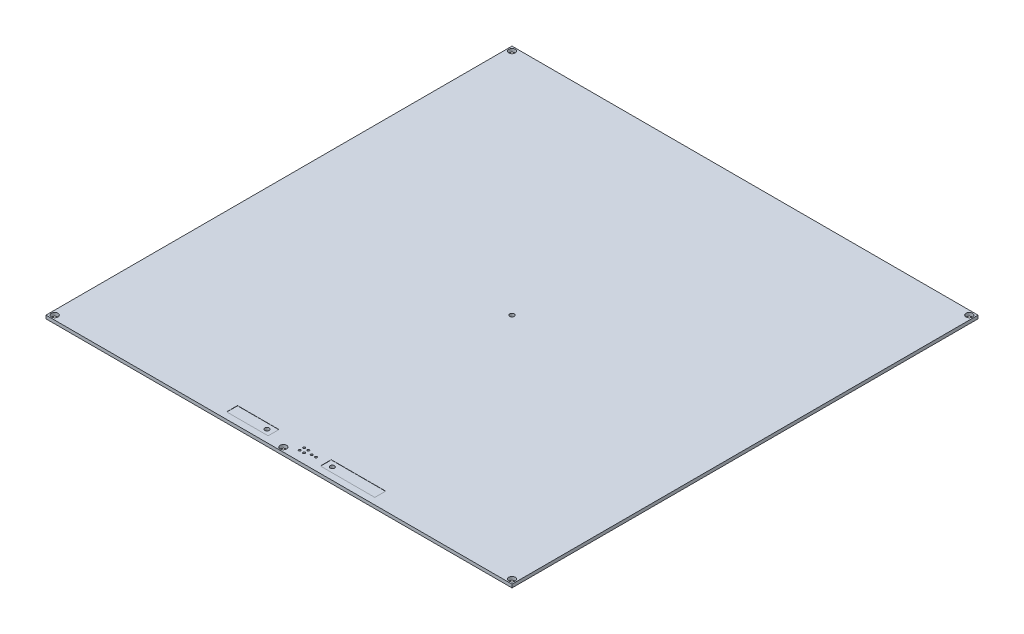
ISO-10303-21;
HEADER;
FILE_DESCRIPTION(('STEP AP214'),'2;1');
FILE_NAME('part.step','',(''),(''),'','','');
FILE_SCHEMA(('AUTOMOTIVE_DESIGN { 1 0 10303 214 1 1 1 1 }'));
ENDSEC;
DATA;
#1=APPLICATION_CONTEXT('core data for automotive mechanical design processes');
#2=APPLICATION_PROTOCOL_DEFINITION('international standard','automotive_design',2000,#1);
#3=PRODUCT_CONTEXT('',#1,'mechanical');
#4=PRODUCT('Part','Part','',(#3));
#5=PRODUCT_RELATED_PRODUCT_CATEGORY('part','',(#4));
#6=PRODUCT_DEFINITION_FORMATION('','',#4);
#7=PRODUCT_DEFINITION_CONTEXT('part definition',#1,'design');
#8=PRODUCT_DEFINITION('design','',#6,#7);
#9=PRODUCT_DEFINITION_SHAPE('','',#8);
#10=(LENGTH_UNIT() NAMED_UNIT(*) SI_UNIT(.MILLI.,.METRE.));
#11=(NAMED_UNIT(*) PLANE_ANGLE_UNIT() SI_UNIT($,.RADIAN.));
#12=(NAMED_UNIT(*) SI_UNIT($,.STERADIAN.) SOLID_ANGLE_UNIT());
#13=UNCERTAINTY_MEASURE_WITH_UNIT(LENGTH_MEASURE(1.E-05),#10,'distance_accuracy_value','');
#14=(GEOMETRIC_REPRESENTATION_CONTEXT(3) GLOBAL_UNCERTAINTY_ASSIGNED_CONTEXT((#13)) GLOBAL_UNIT_ASSIGNED_CONTEXT((#10,
#11,#12)) REPRESENTATION_CONTEXT('',''));
#15=CARTESIAN_POINT('',(0.,0.,0.));
#16=DIRECTION('',(0.,0.,1.));
#17=DIRECTION('',(1.,0.,0.));
#18=AXIS2_PLACEMENT_3D('',#15,#16,#17);
#19=CARTESIAN_POINT('',(19.,0.,101.5));
#20=DIRECTION('',(0.,1.,0.));
#21=DIRECTION('',(0.,0.,1.));
#22=AXIS2_PLACEMENT_3D('',#19,#20,#21);
#23=CYLINDRICAL_SURFACE('',#22,1.);
#24=CARTESIAN_POINT('',(19.,0.,101.5));
#25=DIRECTION('',(0.,1.,0.));
#26=DIRECTION('',(0.,0.,1.));
#27=AXIS2_PLACEMENT_3D('',#24,#25,#26);
#28=CIRCLE('',#27,1.);
#29=CARTESIAN_POINT('',(19.,0.,102.5));
#30=VERTEX_POINT('',#29);
#31=EDGE_CURVE('E233',#30,#30,#28,.T.);
#32=ORIENTED_EDGE('',*,*,#31,.F.);
#33=EDGE_LOOP('',(#32));
#34=FACE_BOUND('',#33,.T.);
#35=CARTESIAN_POINT('',(19.,1.4,101.5));
#36=DIRECTION('',(0.,1.,0.));
#37=DIRECTION('',(0.,0.,1.));
#38=AXIS2_PLACEMENT_3D('',#35,#36,#37);
#39=CIRCLE('',#38,1.);
#40=CARTESIAN_POINT('',(19.,1.4,102.5));
#41=VERTEX_POINT('',#40);
#42=EDGE_CURVE('E36',#41,#41,#39,.F.);
#43=ORIENTED_EDGE('',*,*,#42,.F.);
#44=EDGE_LOOP('',(#43));
#45=FACE_BOUND('',#44,.T.);
#46=ADVANCED_FACE('F32',(#34,#45),#23,.F.);
#47=CARTESIAN_POINT('',(-11.,0.,101.5));
#48=DIRECTION('',(0.,1.,0.));
#49=DIRECTION('',(0.,0.,1.));
#50=AXIS2_PLACEMENT_3D('',#47,#48,#49);
#51=CYLINDRICAL_SURFACE('',#50,1.);
#52=CARTESIAN_POINT('',(-11.,0.,101.5));
#53=DIRECTION('',(0.,1.,0.));
#54=DIRECTION('',(0.,0.,1.));
#55=AXIS2_PLACEMENT_3D('',#52,#53,#54);
#56=CIRCLE('',#55,1.);
#57=CARTESIAN_POINT('',(-11.,0.,102.5));
#58=VERTEX_POINT('',#57);
#59=EDGE_CURVE('E238',#58,#58,#56,.T.);
#60=ORIENTED_EDGE('',*,*,#59,.F.);
#61=EDGE_LOOP('',(#60));
#62=FACE_BOUND('',#61,.T.);
#63=CARTESIAN_POINT('',(-11.,1.4,101.5));
#64=DIRECTION('',(0.,1.,0.));
#65=DIRECTION('',(0.,0.,1.));
#66=AXIS2_PLACEMENT_3D('',#63,#64,#65);
#67=CIRCLE('',#66,1.);
#68=CARTESIAN_POINT('',(-11.,1.4,102.5));
#69=VERTEX_POINT('',#68);
#70=EDGE_CURVE('E187',#69,#69,#67,.F.);
#71=ORIENTED_EDGE('',*,*,#70,.F.);
#72=EDGE_LOOP('',(#71));
#73=FACE_BOUND('',#72,.T.);
#74=ADVANCED_FACE('F301',(#62,#73),#51,.F.);
#75=CARTESIAN_POINT('',(-107.,1.5,107.));
#76=DIRECTION('',(0.,-1.,0.));
#77=DIRECTION('',(0.,0.,-1.));
#78=AXIS2_PLACEMENT_3D('',#75,#76,#77);
#79=PLANE('',#78);
#80=DIRECTION('',(1.,0.,0.));
#81=VECTOR('',#80,1.);
#82=CARTESIAN_POINT('',(16.,1.5,104.));
#83=LINE('',#82,#81);
#84=CARTESIAN_POINT('',(16.,1.5,104.));
#85=VERTEX_POINT('',#84);
#86=CARTESIAN_POINT('',(41.,1.5,104.));
#87=VERTEX_POINT('',#86);
#88=EDGE_CURVE('E153',#85,#87,#83,.T.);
#89=ORIENTED_EDGE('',*,*,#88,.F.);
#90=DIRECTION('',(0.,0.,1.));
#91=VECTOR('',#90,1.);
#92=CARTESIAN_POINT('',(16.,1.5,99.));
#93=LINE('',#92,#91);
#94=CARTESIAN_POINT('',(16.,1.5,99.));
#95=VERTEX_POINT('',#94);
#96=EDGE_CURVE('E49',#95,#85,#93,.T.);
#97=ORIENTED_EDGE('',*,*,#96,.F.);
#98=DIRECTION('',(-1.,0.,0.));
#99=VECTOR('',#98,1.);
#100=CARTESIAN_POINT('',(16.,1.5,99.));
#101=LINE('',#100,#99);
#102=CARTESIAN_POINT('',(41.,1.5,99.));
#103=VERTEX_POINT('',#102);
#104=EDGE_CURVE('E144',#103,#95,#101,.T.);
#105=ORIENTED_EDGE('',*,*,#104,.F.);
#106=DIRECTION('',(0.,0.,-1.));
#107=VECTOR('',#106,1.);
#108=CARTESIAN_POINT('',(41.,1.5,99.));
#109=LINE('',#108,#107);
#110=EDGE_CURVE('E147',#87,#103,#109,.T.);
#111=ORIENTED_EDGE('',*,*,#110,.F.);
#112=EDGE_LOOP('',(#89,#97,#105,#111));
#113=FACE_BOUND('',#112,.T.);
#114=DIRECTION('',(1.,0.,0.));
#115=VECTOR('',#114,1.);
#116=CARTESIAN_POINT('',(-27.0506494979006,1.5,104.));
#117=LINE('',#116,#115);
#118=CARTESIAN_POINT('',(-27.0506494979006,1.5,104.));
#119=VERTEX_POINT('',#118);
#120=CARTESIAN_POINT('',(-8.,1.5,104.));
#121=VERTEX_POINT('',#120);
#122=EDGE_CURVE('E177',#119,#121,#117,.T.);
#123=ORIENTED_EDGE('',*,*,#122,.F.);
#124=DIRECTION('',(0.,0.,1.));
#125=VECTOR('',#124,1.);
#126=CARTESIAN_POINT('',(-27.0506494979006,1.5,99.));
#127=LINE('',#126,#125);
#128=CARTESIAN_POINT('',(-27.0506494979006,1.5,99.));
#129=VERTEX_POINT('',#128);
#130=EDGE_CURVE('E57',#129,#119,#127,.T.);
#131=ORIENTED_EDGE('',*,*,#130,.F.);
#132=DIRECTION('',(-1.,0.,0.));
#133=VECTOR('',#132,1.);
#134=CARTESIAN_POINT('',(-27.0506494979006,1.5,99.));
#135=LINE('',#134,#133);
#136=CARTESIAN_POINT('',(-8.,1.5,99.));
#137=VERTEX_POINT('',#136);
#138=EDGE_CURVE('E166',#137,#129,#135,.T.);
#139=ORIENTED_EDGE('',*,*,#138,.F.);
#140=DIRECTION('',(0.,0.,-1.));
#141=VECTOR('',#140,1.);
#142=CARTESIAN_POINT('',(-8.,1.5,99.));
#143=LINE('',#142,#141);
#144=EDGE_CURVE('E180',#121,#137,#143,.T.);
#145=ORIENTED_EDGE('',*,*,#144,.F.);
#146=EDGE_LOOP('',(#123,#131,#139,#145));
#147=FACE_BOUND('',#146,.T.);
#148=CARTESIAN_POINT('',(0.,1.5,0.));
#149=DIRECTION('',(0.,1.,0.));
#150=DIRECTION('',(0.,0.,1.));
#151=AXIS2_PLACEMENT_3D('',#148,#149,#150);
#152=CIRCLE('',#151,1.05);
#153=CARTESIAN_POINT('',(0.,1.5,1.05));
#154=VERTEX_POINT('',#153);
#155=EDGE_CURVE('E197',#154,#154,#152,.T.);
#156=ORIENTED_EDGE('',*,*,#155,.F.);
#157=EDGE_LOOP('',(#156));
#158=FACE_BOUND('',#157,.T.);
#159=CARTESIAN_POINT('',(11.5,1.5,101.5));
#160=DIRECTION('',(0.,1.,0.));
#161=DIRECTION('',(0.,0.,1.));
#162=AXIS2_PLACEMENT_3D('',#159,#160,#161);
#163=CIRCLE('',#162,0.500000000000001);
#164=CARTESIAN_POINT('',(11.5,1.5,102.));
#165=VERTEX_POINT('',#164);
#166=EDGE_CURVE('E196',#165,#165,#163,.T.);
#167=ORIENTED_EDGE('',*,*,#166,.F.);
#168=EDGE_LOOP('',(#167));
#169=FACE_BOUND('',#168,.T.);
#170=CARTESIAN_POINT('',(9.5,1.5,101.5));
#171=DIRECTION('',(0.,1.,0.));
#172=DIRECTION('',(0.,0.,1.));
#173=AXIS2_PLACEMENT_3D('',#170,#171,#172);
#174=CIRCLE('',#173,0.500000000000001);
#175=CARTESIAN_POINT('',(9.5,1.5,102.));
#176=VERTEX_POINT('',#175);
#177=EDGE_CURVE('E203',#176,#176,#174,.T.);
#178=ORIENTED_EDGE('',*,*,#177,.F.);
#179=EDGE_LOOP('',(#178));
#180=FACE_BOUND('',#179,.T.);
#181=CARTESIAN_POINT('',(7.,1.5,102.5));
#182=DIRECTION('',(0.,1.,0.));
#183=DIRECTION('',(0.,0.,1.));
#184=AXIS2_PLACEMENT_3D('',#181,#182,#183);
#185=CIRCLE('',#184,0.500000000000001);
#186=CARTESIAN_POINT('',(7.,1.5,103.));
#187=VERTEX_POINT('',#186);
#188=EDGE_CURVE('E209',#187,#187,#185,.T.);
#189=ORIENTED_EDGE('',*,*,#188,.F.);
#190=EDGE_LOOP('',(#189));
#191=FACE_BOUND('',#190,.T.);
#192=CARTESIAN_POINT('',(7.,1.5,100.5));
#193=DIRECTION('',(0.,1.,0.));
#194=DIRECTION('',(0.,0.,1.));
#195=AXIS2_PLACEMENT_3D('',#192,#193,#194);
#196=CIRCLE('',#195,0.500000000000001);
#197=CARTESIAN_POINT('',(7.,1.5,101.));
#198=VERTEX_POINT('',#197);
#199=EDGE_CURVE('E215',#198,#198,#196,.T.);
#200=ORIENTED_EDGE('',*,*,#199,.F.);
#201=EDGE_LOOP('',(#200));
#202=FACE_BOUND('',#201,.T.);
#203=CARTESIAN_POINT('',(5.,1.5,102.5));
#204=DIRECTION('',(0.,1.,0.));
#205=DIRECTION('',(0.,0.,1.));
#206=AXIS2_PLACEMENT_3D('',#203,#204,#205);
#207=CIRCLE('',#206,0.5);
#208=CARTESIAN_POINT('',(5.,1.5,103.));
#209=VERTEX_POINT('',#208);
#210=EDGE_CURVE('E221',#209,#209,#207,.T.);
#211=ORIENTED_EDGE('',*,*,#210,.F.);
#212=EDGE_LOOP('',(#211));
#213=FACE_BOUND('',#212,.T.);
#214=CARTESIAN_POINT('',(5.,1.5,100.5));
#215=DIRECTION('',(0.,1.,0.));
#216=DIRECTION('',(0.,0.,1.));
#217=AXIS2_PLACEMENT_3D('',#214,#215,#216);
#218=CIRCLE('',#217,0.500000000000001);
#219=CARTESIAN_POINT('',(5.,1.5,101.));
#220=VERTEX_POINT('',#219);
#221=EDGE_CURVE('E227',#220,#220,#218,.T.);
#222=ORIENTED_EDGE('',*,*,#221,.F.);
#223=EDGE_LOOP('',(#222));
#224=FACE_BOUND('',#223,.T.);
#225=CARTESIAN_POINT('',(0.,1.5,105.));
#226=DIRECTION('',(0.,1.,0.));
#227=DIRECTION('',(0.,0.,1.));
#228=AXIS2_PLACEMENT_3D('',#225,#226,#227);
#229=CIRCLE('',#228,1.5);
#230=CARTESIAN_POINT('',(0.,1.5,106.5));
#231=VERTEX_POINT('',#230);
#232=EDGE_CURVE('E241',#231,#231,#229,.T.);
#233=ORIENTED_EDGE('',*,*,#232,.F.);
#234=EDGE_LOOP('',(#233));
#235=FACE_BOUND('',#234,.T.);
#236=CARTESIAN_POINT('',(105.,1.5,105.));
#237=DIRECTION('',(0.,1.,0.));
#238=DIRECTION('',(0.,0.,-1.));
#239=AXIS2_PLACEMENT_3D('',#236,#237,#238);
#240=CIRCLE('',#239,1.5);
#241=CARTESIAN_POINT('',(105.,1.5,103.5));
#242=VERTEX_POINT('',#241);
#243=EDGE_CURVE('E245',#242,#242,#240,.T.);
#244=ORIENTED_EDGE('',*,*,#243,.F.);
#245=EDGE_LOOP('',(#244));
#246=FACE_BOUND('',#245,.T.);
#247=CARTESIAN_POINT('',(-105.,1.5,105.));
#248=DIRECTION('',(0.,-1.,0.));
#249=DIRECTION('',(0.,0.,-1.));
#250=AXIS2_PLACEMENT_3D('',#247,#248,#249);
#251=CIRCLE('',#250,1.5);
#252=CARTESIAN_POINT('',(-105.,1.5,103.5));
#253=VERTEX_POINT('',#252);
#254=EDGE_CURVE('E257',#253,#253,#251,.T.);
#255=ORIENTED_EDGE('',*,*,#254,.T.);
#256=EDGE_LOOP('',(#255));
#257=FACE_BOUND('',#256,.T.);
#258=CARTESIAN_POINT('',(-105.,1.5,-105.));
#259=DIRECTION('',(0.,1.,0.));
#260=DIRECTION('',(0.,0.,1.));
#261=AXIS2_PLACEMENT_3D('',#258,#259,#260);
#262=CIRCLE('',#261,1.5);
#263=CARTESIAN_POINT('',(-105.,1.5,-103.5));
#264=VERTEX_POINT('',#263);
#265=EDGE_CURVE('E263',#264,#264,#262,.T.);
#266=ORIENTED_EDGE('',*,*,#265,.F.);
#267=EDGE_LOOP('',(#266));
#268=FACE_BOUND('',#267,.T.);
#269=DIRECTION('',(0.,0.,1.));
#270=VECTOR('',#269,1.);
#271=CARTESIAN_POINT('',(-107.,1.5,-107.));
#272=LINE('',#271,#270);
#273=CARTESIAN_POINT('',(-107.,1.5,-107.));
#274=VERTEX_POINT('',#273);
#275=CARTESIAN_POINT('',(-107.,1.5,107.));
#276=VERTEX_POINT('',#275);
#277=EDGE_CURVE('E272',#274,#276,#272,.T.);
#278=ORIENTED_EDGE('',*,*,#277,.T.);
#279=DIRECTION('',(1.,0.,0.));
#280=VECTOR('',#279,1.);
#281=CARTESIAN_POINT('',(107.,1.5,107.));
#282=LINE('',#281,#280);
#283=CARTESIAN_POINT('',(107.,1.5,107.));
#284=VERTEX_POINT('',#283);
#285=EDGE_CURVE('E275',#276,#284,#282,.T.);
#286=ORIENTED_EDGE('',*,*,#285,.T.);
#287=DIRECTION('',(0.,0.,-1.));
#288=VECTOR('',#287,1.);
#289=CARTESIAN_POINT('',(107.,1.5,-107.));
#290=LINE('',#289,#288);
#291=CARTESIAN_POINT('',(107.,1.5,-107.));
#292=VERTEX_POINT('',#291);
#293=EDGE_CURVE('E278',#284,#292,#290,.T.);
#294=ORIENTED_EDGE('',*,*,#293,.T.);
#295=DIRECTION('',(-1.,0.,0.));
#296=VECTOR('',#295,1.);
#297=CARTESIAN_POINT('',(107.,1.5,-107.));
#298=LINE('',#297,#296);
#299=EDGE_CURVE('E280',#292,#274,#298,.T.);
#300=ORIENTED_EDGE('',*,*,#299,.T.);
#301=EDGE_LOOP('',(#278,#286,#294,#300));
#302=FACE_BOUND('',#301,.T.);
#303=CARTESIAN_POINT('',(105.,1.5,-105.));
#304=DIRECTION('',(0.,-1.,0.));
#305=DIRECTION('',(0.,0.,1.));
#306=AXIS2_PLACEMENT_3D('',#303,#304,#305);
#307=CIRCLE('',#306,1.5);
#308=CARTESIAN_POINT('',(105.,1.5,-103.5));
#309=VERTEX_POINT('',#308);
#310=EDGE_CURVE('E251',#309,#309,#307,.T.);
#311=ORIENTED_EDGE('',*,*,#310,.T.);
#312=EDGE_LOOP('',(#311));
#313=FACE_BOUND('',#312,.T.);
#314=ADVANCED_FACE('F303',(#113,#147,#158,#169,#180,#191,#202,#213,#224,#235,#246,#257,#268,
#302,#313),#79,.F.);
#315=CARTESIAN_POINT('',(-107.,0.,107.));
#316=DIRECTION('',(0.,-1.,0.));
#317=DIRECTION('',(0.,0.,-1.));
#318=AXIS2_PLACEMENT_3D('',#315,#316,#317);
#319=PLANE('',#318);
#320=CARTESIAN_POINT('',(0.,0.,0.));
#321=DIRECTION('',(0.,1.,0.));
#322=DIRECTION('',(0.,0.,1.));
#323=AXIS2_PLACEMENT_3D('',#320,#321,#322);
#324=CIRCLE('',#323,1.05);
#325=CARTESIAN_POINT('',(0.,0.,1.05));
#326=VERTEX_POINT('',#325);
#327=EDGE_CURVE('E193',#326,#326,#324,.T.);
#328=ORIENTED_EDGE('',*,*,#327,.T.);
#329=EDGE_LOOP('',(#328));
#330=FACE_BOUND('',#329,.T.);
#331=CARTESIAN_POINT('',(11.5,0.,101.5));
#332=DIRECTION('',(0.,1.,0.));
#333=DIRECTION('',(0.,0.,1.));
#334=AXIS2_PLACEMENT_3D('',#331,#332,#333);
#335=CIRCLE('',#334,0.500000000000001);
#336=CARTESIAN_POINT('',(11.5,0.,102.));
#337=VERTEX_POINT('',#336);
#338=EDGE_CURVE('E200',#337,#337,#335,.T.);
#339=ORIENTED_EDGE('',*,*,#338,.T.);
#340=EDGE_LOOP('',(#339));
#341=FACE_BOUND('',#340,.T.);
#342=CARTESIAN_POINT('',(9.5,0.,101.5));
#343=DIRECTION('',(0.,1.,0.));
#344=DIRECTION('',(0.,0.,1.));
#345=AXIS2_PLACEMENT_3D('',#342,#343,#344);
#346=CIRCLE('',#345,0.500000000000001);
#347=CARTESIAN_POINT('',(9.5,0.,102.));
#348=VERTEX_POINT('',#347);
#349=EDGE_CURVE('E206',#348,#348,#346,.T.);
#350=ORIENTED_EDGE('',*,*,#349,.T.);
#351=EDGE_LOOP('',(#350));
#352=FACE_BOUND('',#351,.T.);
#353=CARTESIAN_POINT('',(7.,0.,102.5));
#354=DIRECTION('',(0.,1.,0.));
#355=DIRECTION('',(0.,0.,1.));
#356=AXIS2_PLACEMENT_3D('',#353,#354,#355);
#357=CIRCLE('',#356,0.500000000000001);
#358=CARTESIAN_POINT('',(7.,0.,103.));
#359=VERTEX_POINT('',#358);
#360=EDGE_CURVE('E212',#359,#359,#357,.T.);
#361=ORIENTED_EDGE('',*,*,#360,.T.);
#362=EDGE_LOOP('',(#361));
#363=FACE_BOUND('',#362,.T.);
#364=CARTESIAN_POINT('',(7.,0.,100.5));
#365=DIRECTION('',(0.,1.,0.));
#366=DIRECTION('',(0.,0.,1.));
#367=AXIS2_PLACEMENT_3D('',#364,#365,#366);
#368=CIRCLE('',#367,0.500000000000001);
#369=CARTESIAN_POINT('',(7.,0.,101.));
#370=VERTEX_POINT('',#369);
#371=EDGE_CURVE('E218',#370,#370,#368,.T.);
#372=ORIENTED_EDGE('',*,*,#371,.T.);
#373=EDGE_LOOP('',(#372));
#374=FACE_BOUND('',#373,.T.);
#375=CARTESIAN_POINT('',(5.,0.,102.5));
#376=DIRECTION('',(0.,1.,0.));
#377=DIRECTION('',(0.,0.,1.));
#378=AXIS2_PLACEMENT_3D('',#375,#376,#377);
#379=CIRCLE('',#378,0.5);
#380=CARTESIAN_POINT('',(5.,0.,103.));
#381=VERTEX_POINT('',#380);
#382=EDGE_CURVE('E224',#381,#381,#379,.T.);
#383=ORIENTED_EDGE('',*,*,#382,.T.);
#384=EDGE_LOOP('',(#383));
#385=FACE_BOUND('',#384,.T.);
#386=CARTESIAN_POINT('',(5.,0.,100.5));
#387=DIRECTION('',(0.,1.,0.));
#388=DIRECTION('',(0.,0.,1.));
#389=AXIS2_PLACEMENT_3D('',#386,#387,#388);
#390=CIRCLE('',#389,0.500000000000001);
#391=CARTESIAN_POINT('',(5.,0.,101.));
#392=VERTEX_POINT('',#391);
#393=EDGE_CURVE('E230',#392,#392,#390,.T.);
#394=ORIENTED_EDGE('',*,*,#393,.T.);
#395=EDGE_LOOP('',(#394));
#396=FACE_BOUND('',#395,.T.);
#397=ORIENTED_EDGE('',*,*,#31,.T.);
#398=EDGE_LOOP('',(#397));
#399=FACE_BOUND('',#398,.T.);
#400=ORIENTED_EDGE('',*,*,#59,.T.);
#401=EDGE_LOOP('',(#400));
#402=FACE_BOUND('',#401,.T.);
#403=CARTESIAN_POINT('',(0.,0.,105.));
#404=DIRECTION('',(0.,1.,0.));
#405=DIRECTION('',(0.,0.,1.));
#406=AXIS2_PLACEMENT_3D('',#403,#404,#405);
#407=CIRCLE('',#406,1.5);
#408=CARTESIAN_POINT('',(0.,0.,106.5));
#409=VERTEX_POINT('',#408);
#410=EDGE_CURVE('E242',#409,#409,#407,.T.);
#411=ORIENTED_EDGE('',*,*,#410,.T.);
#412=EDGE_LOOP('',(#411));
#413=FACE_BOUND('',#412,.T.);
#414=CARTESIAN_POINT('',(105.,0.,105.));
#415=DIRECTION('',(0.,1.,0.));
#416=DIRECTION('',(0.,0.,-1.));
#417=AXIS2_PLACEMENT_3D('',#414,#415,#416);
#418=CIRCLE('',#417,1.5);
#419=CARTESIAN_POINT('',(105.,0.,103.5));
#420=VERTEX_POINT('',#419);
#421=EDGE_CURVE('E248',#420,#420,#418,.T.);
#422=ORIENTED_EDGE('',*,*,#421,.T.);
#423=EDGE_LOOP('',(#422));
#424=FACE_BOUND('',#423,.T.);
#425=CARTESIAN_POINT('',(-105.,0.,105.));
#426=DIRECTION('',(0.,-1.,0.));
#427=DIRECTION('',(0.,0.,-1.));
#428=AXIS2_PLACEMENT_3D('',#425,#426,#427);
#429=CIRCLE('',#428,1.5);
#430=CARTESIAN_POINT('',(-105.,0.,103.5));
#431=VERTEX_POINT('',#430);
#432=EDGE_CURVE('E260',#431,#431,#429,.T.);
#433=ORIENTED_EDGE('',*,*,#432,.F.);
#434=EDGE_LOOP('',(#433));
#435=FACE_BOUND('',#434,.T.);
#436=CARTESIAN_POINT('',(-105.,0.,-105.));
#437=DIRECTION('',(0.,1.,0.));
#438=DIRECTION('',(0.,0.,1.));
#439=AXIS2_PLACEMENT_3D('',#436,#437,#438);
#440=CIRCLE('',#439,1.5);
#441=CARTESIAN_POINT('',(-105.,0.,-103.5));
#442=VERTEX_POINT('',#441);
#443=EDGE_CURVE('E266',#442,#442,#440,.T.);
#444=ORIENTED_EDGE('',*,*,#443,.T.);
#445=EDGE_LOOP('',(#444));
#446=FACE_BOUND('',#445,.T.);
#447=DIRECTION('',(0.,0.,1.));
#448=VECTOR('',#447,1.);
#449=CARTESIAN_POINT('',(-107.,0.,-107.));
#450=LINE('',#449,#448);
#451=CARTESIAN_POINT('',(-107.,0.,-107.));
#452=VERTEX_POINT('',#451);
#453=CARTESIAN_POINT('',(-107.,0.,107.));
#454=VERTEX_POINT('',#453);
#455=EDGE_CURVE('E269',#452,#454,#450,.T.);
#456=ORIENTED_EDGE('',*,*,#455,.F.);
#457=DIRECTION('',(-1.,0.,0.));
#458=VECTOR('',#457,1.);
#459=CARTESIAN_POINT('',(107.,0.,-107.));
#460=LINE('',#459,#458);
#461=CARTESIAN_POINT('',(107.,0.,-107.));
#462=VERTEX_POINT('',#461);
#463=EDGE_CURVE('E276',#462,#452,#460,.T.);
#464=ORIENTED_EDGE('',*,*,#463,.F.);
#465=DIRECTION('',(0.,0.,-1.));
#466=VECTOR('',#465,1.);
#467=CARTESIAN_POINT('',(107.,0.,-107.));
#468=LINE('',#467,#466);
#469=CARTESIAN_POINT('',(107.,0.,107.));
#470=VERTEX_POINT('',#469);
#471=EDGE_CURVE('E287',#470,#462,#468,.T.);
#472=ORIENTED_EDGE('',*,*,#471,.F.);
#473=DIRECTION('',(1.,0.,0.));
#474=VECTOR('',#473,1.);
#475=CARTESIAN_POINT('',(107.,0.,107.));
#476=LINE('',#475,#474);
#477=EDGE_CURVE('E285',#454,#470,#476,.T.);
#478=ORIENTED_EDGE('',*,*,#477,.F.);
#479=EDGE_LOOP('',(#456,#464,#472,#478));
#480=FACE_BOUND('',#479,.T.);
#481=CARTESIAN_POINT('',(105.,0.,-105.));
#482=DIRECTION('',(0.,-1.,0.));
#483=DIRECTION('',(0.,0.,1.));
#484=AXIS2_PLACEMENT_3D('',#481,#482,#483);
#485=CIRCLE('',#484,1.5);
#486=CARTESIAN_POINT('',(105.,0.,-103.5));
#487=VERTEX_POINT('',#486);
#488=EDGE_CURVE('E254',#487,#487,#485,.T.);
#489=ORIENTED_EDGE('',*,*,#488,.F.);
#490=EDGE_LOOP('',(#489));
#491=FACE_BOUND('',#490,.T.);
#492=ADVANCED_FACE('F310',(#330,#341,#352,#363,#374,#385,#396,#399,#402,#413,#424,#435,#446,
#480,#491),#319,.T.);
#493=CARTESIAN_POINT('',(-107.,1.5,-107.));
#494=DIRECTION('',(1.,0.,0.));
#495=DIRECTION('',(0.,0.,-1.));
#496=AXIS2_PLACEMENT_3D('',#493,#494,#495);
#497=PLANE('',#496);
#498=ORIENTED_EDGE('',*,*,#455,.T.);
#499=DIRECTION('',(0.,-1.,0.));
#500=VECTOR('',#499,1.);
#501=CARTESIAN_POINT('',(-107.,1.5,107.));
#502=LINE('',#501,#500);
#503=EDGE_CURVE('E11',#276,#454,#502,.T.);
#504=ORIENTED_EDGE('',*,*,#503,.F.);
#505=ORIENTED_EDGE('',*,*,#277,.F.);
#506=DIRECTION('',(0.,-1.,0.));
#507=VECTOR('',#506,1.);
#508=CARTESIAN_POINT('',(-107.,1.5,-107.));
#509=LINE('',#508,#507);
#510=EDGE_CURVE('E282',#274,#452,#509,.T.);
#511=ORIENTED_EDGE('',*,*,#510,.T.);
#512=EDGE_LOOP('',(#498,#504,#505,#511));
#513=FACE_BOUND('',#512,.T.);
#514=ADVANCED_FACE('F34',(#513),#497,.F.);
#515=CARTESIAN_POINT('',(107.,1.5,107.));
#516=DIRECTION('',(0.,0.,-1.));
#517=DIRECTION('',(-1.,0.,0.));
#518=AXIS2_PLACEMENT_3D('',#515,#516,#517);
#519=PLANE('',#518);
#520=ORIENTED_EDGE('',*,*,#477,.T.);
#521=DIRECTION('',(0.,-1.,0.));
#522=VECTOR('',#521,1.);
#523=CARTESIAN_POINT('',(107.,1.5,107.));
#524=LINE('',#523,#522);
#525=EDGE_CURVE('E41',#284,#470,#524,.T.);
#526=ORIENTED_EDGE('',*,*,#525,.F.);
#527=ORIENTED_EDGE('',*,*,#285,.F.);
#528=ORIENTED_EDGE('',*,*,#503,.T.);
#529=EDGE_LOOP('',(#520,#526,#527,#528));
#530=FACE_BOUND('',#529,.T.);
#531=ADVANCED_FACE('F348',(#530),#519,.F.);
#532=CARTESIAN_POINT('',(107.,1.5,-107.));
#533=DIRECTION('',(-1.,0.,0.));
#534=DIRECTION('',(0.,0.,1.));
#535=AXIS2_PLACEMENT_3D('',#532,#533,#534);
#536=PLANE('',#535);
#537=ORIENTED_EDGE('',*,*,#471,.T.);
#538=DIRECTION('',(0.,-1.,0.));
#539=VECTOR('',#538,1.);
#540=CARTESIAN_POINT('',(107.,1.5,-107.));
#541=LINE('',#540,#539);
#542=EDGE_CURVE('E292',#292,#462,#541,.T.);
#543=ORIENTED_EDGE('',*,*,#542,.F.);
#544=ORIENTED_EDGE('',*,*,#293,.F.);
#545=ORIENTED_EDGE('',*,*,#525,.T.);
#546=EDGE_LOOP('',(#537,#543,#544,#545));
#547=FACE_BOUND('',#546,.T.);
#548=ADVANCED_FACE('F345',(#547),#536,.F.);
#549=CARTESIAN_POINT('',(107.,1.5,-107.));
#550=DIRECTION('',(0.,0.,1.));
#551=DIRECTION('',(1.,0.,0.));
#552=AXIS2_PLACEMENT_3D('',#549,#550,#551);
#553=PLANE('',#552);
#554=ORIENTED_EDGE('',*,*,#463,.T.);
#555=ORIENTED_EDGE('',*,*,#510,.F.);
#556=ORIENTED_EDGE('',*,*,#299,.F.);
#557=ORIENTED_EDGE('',*,*,#542,.T.);
#558=EDGE_LOOP('',(#554,#555,#556,#557));
#559=FACE_BOUND('',#558,.T.);
#560=ADVANCED_FACE('F337',(#559),#553,.F.);
#561=CARTESIAN_POINT('',(-105.,0.,-105.));
#562=DIRECTION('',(0.,1.,0.));
#563=DIRECTION('',(0.,0.,1.));
#564=AXIS2_PLACEMENT_3D('',#561,#562,#563);
#565=CYLINDRICAL_SURFACE('',#564,1.5);
#566=ORIENTED_EDGE('',*,*,#443,.F.);
#567=EDGE_LOOP('',(#566));
#568=FACE_BOUND('',#567,.T.);
#569=ORIENTED_EDGE('',*,*,#265,.T.);
#570=EDGE_LOOP('',(#569));
#571=FACE_BOUND('',#570,.T.);
#572=ADVANCED_FACE('F334',(#568,#571),#565,.F.);
#573=CARTESIAN_POINT('',(-105.,0.,105.));
#574=DIRECTION('',(0.,1.,0.));
#575=DIRECTION('',(0.,0.,1.));
#576=AXIS2_PLACEMENT_3D('',#573,#574,#575);
#577=CYLINDRICAL_SURFACE('',#576,1.5);
#578=ORIENTED_EDGE('',*,*,#432,.T.);
#579=EDGE_LOOP('',(#578));
#580=FACE_BOUND('',#579,.T.);
#581=ORIENTED_EDGE('',*,*,#254,.F.);
#582=EDGE_LOOP('',(#581));
#583=FACE_BOUND('',#582,.T.);
#584=ADVANCED_FACE('F330',(#580,#583),#577,.F.);
#585=CARTESIAN_POINT('',(105.,0.,-105.));
#586=DIRECTION('',(0.,1.,0.));
#587=DIRECTION('',(0.,0.,1.));
#588=AXIS2_PLACEMENT_3D('',#585,#586,#587);
#589=CYLINDRICAL_SURFACE('',#588,1.5);
#590=ORIENTED_EDGE('',*,*,#488,.T.);
#591=EDGE_LOOP('',(#590));
#592=FACE_BOUND('',#591,.T.);
#593=ORIENTED_EDGE('',*,*,#310,.F.);
#594=EDGE_LOOP('',(#593));
#595=FACE_BOUND('',#594,.T.);
#596=ADVANCED_FACE('F326',(#592,#595),#589,.F.);
#597=CARTESIAN_POINT('',(105.,0.,105.));
#598=DIRECTION('',(0.,1.,0.));
#599=DIRECTION('',(0.,0.,1.));
#600=AXIS2_PLACEMENT_3D('',#597,#598,#599);
#601=CYLINDRICAL_SURFACE('',#600,1.5);
#602=ORIENTED_EDGE('',*,*,#421,.F.);
#603=EDGE_LOOP('',(#602));
#604=FACE_BOUND('',#603,.T.);
#605=ORIENTED_EDGE('',*,*,#243,.T.);
#606=EDGE_LOOP('',(#605));
#607=FACE_BOUND('',#606,.T.);
#608=ADVANCED_FACE('F322',(#604,#607),#601,.F.);
#609=CARTESIAN_POINT('',(0.,0.,105.));
#610=DIRECTION('',(0.,1.,0.));
#611=DIRECTION('',(0.,0.,1.));
#612=AXIS2_PLACEMENT_3D('',#609,#610,#611);
#613=CYLINDRICAL_SURFACE('',#612,1.5);
#614=ORIENTED_EDGE('',*,*,#410,.F.);
#615=EDGE_LOOP('',(#614));
#616=FACE_BOUND('',#615,.T.);
#617=ORIENTED_EDGE('',*,*,#232,.T.);
#618=EDGE_LOOP('',(#617));
#619=FACE_BOUND('',#618,.T.);
#620=ADVANCED_FACE('F318',(#616,#619),#613,.F.);
#621=CARTESIAN_POINT('',(5.,0.,100.5));
#622=DIRECTION('',(0.,1.,0.));
#623=DIRECTION('',(0.,0.,1.));
#624=AXIS2_PLACEMENT_3D('',#621,#622,#623);
#625=CYLINDRICAL_SURFACE('',#624,0.500000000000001);
#626=ORIENTED_EDGE('',*,*,#393,.F.);
#627=EDGE_LOOP('',(#626));
#628=FACE_BOUND('',#627,.T.);
#629=ORIENTED_EDGE('',*,*,#221,.T.);
#630=EDGE_LOOP('',(#629));
#631=FACE_BOUND('',#630,.T.);
#632=ADVANCED_FACE('F321',(#628,#631),#625,.F.);
#633=CARTESIAN_POINT('',(5.,0.,102.5));
#634=DIRECTION('',(0.,1.,0.));
#635=DIRECTION('',(0.,0.,1.));
#636=AXIS2_PLACEMENT_3D('',#633,#634,#635);
#637=CYLINDRICAL_SURFACE('',#636,0.5);
#638=ORIENTED_EDGE('',*,*,#382,.F.);
#639=EDGE_LOOP('',(#638));
#640=FACE_BOUND('',#639,.T.);
#641=ORIENTED_EDGE('',*,*,#210,.T.);
#642=EDGE_LOOP('',(#641));
#643=FACE_BOUND('',#642,.T.);
#644=ADVANCED_FACE('F506',(#640,#643),#637,.F.);
#645=CARTESIAN_POINT('',(7.,0.,100.5));
#646=DIRECTION('',(0.,1.,0.));
#647=DIRECTION('',(0.,0.,1.));
#648=AXIS2_PLACEMENT_3D('',#645,#646,#647);
#649=CYLINDRICAL_SURFACE('',#648,0.500000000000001);
#650=ORIENTED_EDGE('',*,*,#371,.F.);
#651=EDGE_LOOP('',(#650));
#652=FACE_BOUND('',#651,.T.);
#653=ORIENTED_EDGE('',*,*,#199,.T.);
#654=EDGE_LOOP('',(#653));
#655=FACE_BOUND('',#654,.T.);
#656=ADVANCED_FACE('F502',(#652,#655),#649,.F.);
#657=CARTESIAN_POINT('',(7.,0.,102.5));
#658=DIRECTION('',(0.,1.,0.));
#659=DIRECTION('',(0.,0.,1.));
#660=AXIS2_PLACEMENT_3D('',#657,#658,#659);
#661=CYLINDRICAL_SURFACE('',#660,0.500000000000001);
#662=ORIENTED_EDGE('',*,*,#360,.F.);
#663=EDGE_LOOP('',(#662));
#664=FACE_BOUND('',#663,.T.);
#665=ORIENTED_EDGE('',*,*,#188,.T.);
#666=EDGE_LOOP('',(#665));
#667=FACE_BOUND('',#666,.T.);
#668=ADVANCED_FACE('F498',(#664,#667),#661,.F.);
#669=CARTESIAN_POINT('',(9.5,0.,101.5));
#670=DIRECTION('',(0.,1.,0.));
#671=DIRECTION('',(0.,0.,1.));
#672=AXIS2_PLACEMENT_3D('',#669,#670,#671);
#673=CYLINDRICAL_SURFACE('',#672,0.500000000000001);
#674=ORIENTED_EDGE('',*,*,#349,.F.);
#675=EDGE_LOOP('',(#674));
#676=FACE_BOUND('',#675,.T.);
#677=ORIENTED_EDGE('',*,*,#177,.T.);
#678=EDGE_LOOP('',(#677));
#679=FACE_BOUND('',#678,.T.);
#680=ADVANCED_FACE('F494',(#676,#679),#673,.F.);
#681=CARTESIAN_POINT('',(11.5,0.,101.5));
#682=DIRECTION('',(0.,1.,0.));
#683=DIRECTION('',(0.,0.,1.));
#684=AXIS2_PLACEMENT_3D('',#681,#682,#683);
#685=CYLINDRICAL_SURFACE('',#684,0.500000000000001);
#686=ORIENTED_EDGE('',*,*,#338,.F.);
#687=EDGE_LOOP('',(#686));
#688=FACE_BOUND('',#687,.T.);
#689=ORIENTED_EDGE('',*,*,#166,.T.);
#690=EDGE_LOOP('',(#689));
#691=FACE_BOUND('',#690,.T.);
#692=ADVANCED_FACE('F490',(#688,#691),#685,.F.);
#693=CARTESIAN_POINT('',(0.,0.,0.));
#694=DIRECTION('',(0.,1.,0.));
#695=DIRECTION('',(0.,0.,1.));
#696=AXIS2_PLACEMENT_3D('',#693,#694,#695);
#697=CYLINDRICAL_SURFACE('',#696,1.05);
#698=ORIENTED_EDGE('',*,*,#327,.F.);
#699=EDGE_LOOP('',(#698));
#700=FACE_BOUND('',#699,.T.);
#701=ORIENTED_EDGE('',*,*,#155,.T.);
#702=EDGE_LOOP('',(#701));
#703=FACE_BOUND('',#702,.T.);
#704=ADVANCED_FACE('F399',(#700,#703),#697,.F.);
#705=CARTESIAN_POINT('',(-27.0506494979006,1.4,104.));
#706=DIRECTION('',(0.,1.,0.));
#707=DIRECTION('',(0.,0.,1.));
#708=AXIS2_PLACEMENT_3D('',#705,#706,#707);
#709=PLANE('',#708);
#710=DIRECTION('',(0.,0.,1.));
#711=VECTOR('',#710,1.);
#712=CARTESIAN_POINT('',(-27.0506494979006,1.4,99.));
#713=LINE('',#712,#711);
#714=CARTESIAN_POINT('',(-27.0506494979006,1.4,99.));
#715=VERTEX_POINT('',#714);
#716=CARTESIAN_POINT('',(-27.0506494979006,1.4,104.));
#717=VERTEX_POINT('',#716);
#718=EDGE_CURVE('E162',#715,#717,#713,.T.);
#719=ORIENTED_EDGE('',*,*,#718,.T.);
#720=DIRECTION('',(1.,0.,0.));
#721=VECTOR('',#720,1.);
#722=CARTESIAN_POINT('',(-27.0506494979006,1.4,104.));
#723=LINE('',#722,#721);
#724=CARTESIAN_POINT('',(-8.,1.4,104.));
#725=VERTEX_POINT('',#724);
#726=EDGE_CURVE('E165',#717,#725,#723,.T.);
#727=ORIENTED_EDGE('',*,*,#726,.T.);
#728=DIRECTION('',(0.,0.,-1.));
#729=VECTOR('',#728,1.);
#730=CARTESIAN_POINT('',(-8.,1.4,99.));
#731=LINE('',#730,#729);
#732=CARTESIAN_POINT('',(-8.,1.4,99.));
#733=VERTEX_POINT('',#732);
#734=EDGE_CURVE('E169',#725,#733,#731,.T.);
#735=ORIENTED_EDGE('',*,*,#734,.T.);
#736=DIRECTION('',(-1.,0.,0.));
#737=VECTOR('',#736,1.);
#738=CARTESIAN_POINT('',(-27.0506494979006,1.4,99.));
#739=LINE('',#738,#737);
#740=EDGE_CURVE('E172',#733,#715,#739,.T.);
#741=ORIENTED_EDGE('',*,*,#740,.T.);
#742=EDGE_LOOP('',(#719,#727,#735,#741));
#743=FACE_BOUND('',#742,.T.);
#744=ORIENTED_EDGE('',*,*,#70,.T.);
#745=EDGE_LOOP('',(#744));
#746=FACE_BOUND('',#745,.T.);
#747=ADVANCED_FACE('F299',(#743,#746),#709,.T.);
#748=CARTESIAN_POINT('',(-27.0506494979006,1.4,99.));
#749=DIRECTION('',(-1.,0.,0.));
#750=DIRECTION('',(0.,0.,1.));
#751=AXIS2_PLACEMENT_3D('',#748,#749,#750);
#752=PLANE('',#751);
#753=ORIENTED_EDGE('',*,*,#130,.T.);
#754=DIRECTION('',(0.,1.,0.));
#755=VECTOR('',#754,1.);
#756=CARTESIAN_POINT('',(-27.0506494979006,1.4,104.));
#757=LINE('',#756,#755);
#758=EDGE_CURVE('E175',#717,#119,#757,.T.);
#759=ORIENTED_EDGE('',*,*,#758,.F.);
#760=ORIENTED_EDGE('',*,*,#718,.F.);
#761=DIRECTION('',(0.,1.,0.));
#762=VECTOR('',#761,1.);
#763=CARTESIAN_POINT('',(-27.0506494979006,1.4,99.));
#764=LINE('',#763,#762);
#765=EDGE_CURVE('E185',#715,#129,#764,.T.);
#766=ORIENTED_EDGE('',*,*,#765,.T.);
#767=EDGE_LOOP('',(#753,#759,#760,#766));
#768=FACE_BOUND('',#767,.T.);
#769=ADVANCED_FACE('F398',(#768),#752,.F.);
#770=CARTESIAN_POINT('',(-27.0506494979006,1.4,99.));
#771=DIRECTION('',(0.,0.,-1.));
#772=DIRECTION('',(-1.,0.,0.));
#773=AXIS2_PLACEMENT_3D('',#770,#771,#772);
#774=PLANE('',#773);
#775=ORIENTED_EDGE('',*,*,#138,.T.);
#776=ORIENTED_EDGE('',*,*,#765,.F.);
#777=ORIENTED_EDGE('',*,*,#740,.F.);
#778=DIRECTION('',(0.,1.,0.));
#779=VECTOR('',#778,1.);
#780=CARTESIAN_POINT('',(-8.,1.4,99.));
#781=LINE('',#780,#779);
#782=EDGE_CURVE('E188',#733,#137,#781,.T.);
#783=ORIENTED_EDGE('',*,*,#782,.T.);
#784=EDGE_LOOP('',(#775,#776,#777,#783));
#785=FACE_BOUND('',#784,.T.);
#786=ADVANCED_FACE('F411',(#785),#774,.F.);
#787=CARTESIAN_POINT('',(-8.,1.4,99.));
#788=DIRECTION('',(1.,0.,0.));
#789=DIRECTION('',(0.,0.,-1.));
#790=AXIS2_PLACEMENT_3D('',#787,#788,#789);
#791=PLANE('',#790);
#792=ORIENTED_EDGE('',*,*,#144,.T.);
#793=ORIENTED_EDGE('',*,*,#782,.F.);
#794=ORIENTED_EDGE('',*,*,#734,.F.);
#795=DIRECTION('',(0.,1.,0.));
#796=VECTOR('',#795,1.);
#797=CARTESIAN_POINT('',(-8.,1.4,104.));
#798=LINE('',#797,#796);
#799=EDGE_CURVE('E190',#725,#121,#798,.T.);
#800=ORIENTED_EDGE('',*,*,#799,.T.);
#801=EDGE_LOOP('',(#792,#793,#794,#800));
#802=FACE_BOUND('',#801,.T.);
#803=ADVANCED_FACE('F420',(#802),#791,.F.);
#804=CARTESIAN_POINT('',(-27.0506494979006,1.4,104.));
#805=DIRECTION('',(0.,0.,1.));
#806=DIRECTION('',(1.,0.,0.));
#807=AXIS2_PLACEMENT_3D('',#804,#805,#806);
#808=PLANE('',#807);
#809=ORIENTED_EDGE('',*,*,#122,.T.);
#810=ORIENTED_EDGE('',*,*,#799,.F.);
#811=ORIENTED_EDGE('',*,*,#726,.F.);
#812=ORIENTED_EDGE('',*,*,#758,.T.);
#813=EDGE_LOOP('',(#809,#810,#811,#812));
#814=FACE_BOUND('',#813,.T.);
#815=ADVANCED_FACE('F430',(#814),#808,.F.);
#816=CARTESIAN_POINT('',(16.,1.4,104.));
#817=DIRECTION('',(0.,1.,0.));
#818=DIRECTION('',(0.,0.,1.));
#819=AXIS2_PLACEMENT_3D('',#816,#817,#818);
#820=PLANE('',#819);
#821=DIRECTION('',(0.,0.,1.));
#822=VECTOR('',#821,1.);
#823=CARTESIAN_POINT('',(16.,1.4,99.));
#824=LINE('',#823,#822);
#825=CARTESIAN_POINT('',(16.,1.4,99.));
#826=VERTEX_POINT('',#825);
#827=CARTESIAN_POINT('',(16.,1.4,104.));
#828=VERTEX_POINT('',#827);
#829=EDGE_CURVE('E125',#826,#828,#824,.T.);
#830=ORIENTED_EDGE('',*,*,#829,.T.);
#831=DIRECTION('',(1.,0.,0.));
#832=VECTOR('',#831,1.);
#833=CARTESIAN_POINT('',(16.,1.4,104.));
#834=LINE('',#833,#832);
#835=CARTESIAN_POINT('',(41.,1.4,104.));
#836=VERTEX_POINT('',#835);
#837=EDGE_CURVE('E134',#828,#836,#834,.T.);
#838=ORIENTED_EDGE('',*,*,#837,.T.);
#839=DIRECTION('',(0.,0.,-1.));
#840=VECTOR('',#839,1.);
#841=CARTESIAN_POINT('',(41.,1.4,99.));
#842=LINE('',#841,#840);
#843=CARTESIAN_POINT('',(41.,1.4,99.));
#844=VERTEX_POINT('',#843);
#845=EDGE_CURVE('E139',#836,#844,#842,.T.);
#846=ORIENTED_EDGE('',*,*,#845,.T.);
#847=DIRECTION('',(-1.,0.,0.));
#848=VECTOR('',#847,1.);
#849=CARTESIAN_POINT('',(16.,1.4,99.));
#850=LINE('',#849,#848);
#851=EDGE_CURVE('E131',#844,#826,#850,.T.);
#852=ORIENTED_EDGE('',*,*,#851,.T.);
#853=EDGE_LOOP('',(#830,#838,#846,#852));
#854=FACE_BOUND('',#853,.T.);
#855=ORIENTED_EDGE('',*,*,#42,.T.);
#856=EDGE_LOOP('',(#855));
#857=FACE_BOUND('',#856,.T.);
#858=ADVANCED_FACE('F141',(#854,#857),#820,.T.);
#859=CARTESIAN_POINT('',(16.,1.4,99.));
#860=DIRECTION('',(-1.,0.,0.));
#861=DIRECTION('',(0.,0.,1.));
#862=AXIS2_PLACEMENT_3D('',#859,#860,#861);
#863=PLANE('',#862);
#864=ORIENTED_EDGE('',*,*,#96,.T.);
#865=DIRECTION('',(0.,1.,0.));
#866=VECTOR('',#865,1.);
#867=CARTESIAN_POINT('',(16.,1.4,104.));
#868=LINE('',#867,#866);
#869=EDGE_CURVE('E121',#828,#85,#868,.T.);
#870=ORIENTED_EDGE('',*,*,#869,.F.);
#871=ORIENTED_EDGE('',*,*,#829,.F.);
#872=DIRECTION('',(0.,1.,0.));
#873=VECTOR('',#872,1.);
#874=CARTESIAN_POINT('',(16.,1.4,99.));
#875=LINE('',#874,#873);
#876=EDGE_CURVE('E157',#826,#95,#875,.T.);
#877=ORIENTED_EDGE('',*,*,#876,.T.);
#878=EDGE_LOOP('',(#864,#870,#871,#877));
#879=FACE_BOUND('',#878,.T.);
#880=ADVANCED_FACE('F123',(#879),#863,.F.);
#881=CARTESIAN_POINT('',(16.,1.4,99.));
#882=DIRECTION('',(0.,0.,-1.));
#883=DIRECTION('',(-1.,0.,0.));
#884=AXIS2_PLACEMENT_3D('',#881,#882,#883);
#885=PLANE('',#884);
#886=ORIENTED_EDGE('',*,*,#104,.T.);
#887=ORIENTED_EDGE('',*,*,#876,.F.);
#888=ORIENTED_EDGE('',*,*,#851,.F.);
#889=DIRECTION('',(0.,1.,0.));
#890=VECTOR('',#889,1.);
#891=CARTESIAN_POINT('',(41.,1.4,99.));
#892=LINE('',#891,#890);
#893=EDGE_CURVE('E159',#844,#103,#892,.T.);
#894=ORIENTED_EDGE('',*,*,#893,.T.);
#895=EDGE_LOOP('',(#886,#887,#888,#894));
#896=FACE_BOUND('',#895,.T.);
#897=ADVANCED_FACE('F457',(#896),#885,.F.);
#898=CARTESIAN_POINT('',(41.,1.4,99.));
#899=DIRECTION('',(1.,0.,0.));
#900=DIRECTION('',(0.,0.,-1.));
#901=AXIS2_PLACEMENT_3D('',#898,#899,#900);
#902=PLANE('',#901);
#903=ORIENTED_EDGE('',*,*,#110,.T.);
#904=ORIENTED_EDGE('',*,*,#893,.F.);
#905=ORIENTED_EDGE('',*,*,#845,.F.);
#906=DIRECTION('',(0.,1.,0.));
#907=VECTOR('',#906,1.);
#908=CARTESIAN_POINT('',(41.,1.4,104.));
#909=LINE('',#908,#907);
#910=EDGE_CURVE('E130',#836,#87,#909,.T.);
#911=ORIENTED_EDGE('',*,*,#910,.T.);
#912=EDGE_LOOP('',(#903,#904,#905,#911));
#913=FACE_BOUND('',#912,.T.);
#914=ADVANCED_FACE('F466',(#913),#902,.F.);
#915=CARTESIAN_POINT('',(16.,1.4,104.));
#916=DIRECTION('',(0.,0.,1.));
#917=DIRECTION('',(1.,0.,0.));
#918=AXIS2_PLACEMENT_3D('',#915,#916,#917);
#919=PLANE('',#918);
#920=ORIENTED_EDGE('',*,*,#88,.T.);
#921=ORIENTED_EDGE('',*,*,#910,.F.);
#922=ORIENTED_EDGE('',*,*,#837,.F.);
#923=ORIENTED_EDGE('',*,*,#869,.T.);
#924=EDGE_LOOP('',(#920,#921,#922,#923));
#925=FACE_BOUND('',#924,.T.);
#926=ADVANCED_FACE('F135',(#925),#919,.F.);
#927=CLOSED_SHELL('',(#46,#74,#314,#492,#514,#531,#548,#560,#572,#584,#596,#608,#620,#632,#644,
#656,#668,#680,#692,#704,#747,#769,#786,#803,#815,#858,#880,#897,#914,#926));
#928=MANIFOLD_SOLID_BREP('B2',#927);
#929=ADVANCED_BREP_SHAPE_REPRESENTATION('',(#18,#928),#14);
#930=SHAPE_DEFINITION_REPRESENTATION(#9,#929);
ENDSEC;
END-ISO-10303-21;
